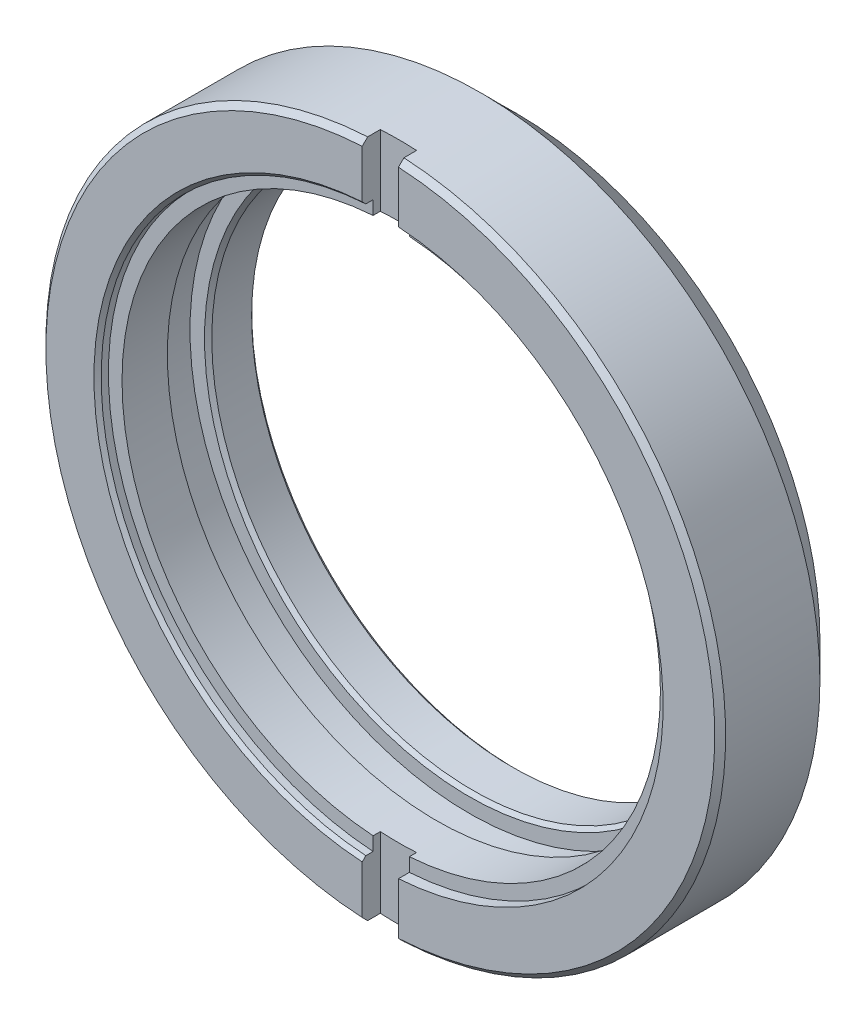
from build123d import *

# Parameters (mm, degrees)
SKETCH1_R             = 23.8125
BAR_DEPTH             = 9.525
SKETCH2_R             = 19.812
SBE_C_BORE_DEPTH      = 0.762
SKETCH4_R             = 18.8595
SBE_PUMP_THREAD_DEPTH = 5.461
SKETCH5_R             = 18.288
SBE_ORING_BORE_DEPTH  = 35.246109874
CHAMFER2_SIZE         = 0.381
SKETCH6_W             = 2.54
SKETCH6_H             = 50.8
DRIVE_SLOTS_DEPTH     = 1.27
ORING_CHAMFER_SIZE    = 2.54
SKETCH7_R             = 19.558
THREAD_RELIF_DEPTH    = 2.286
CHAMFER4_SIZE         = 0.254


with BuildPart() as part:
    # Sketch1 → bar (new body)
    with BuildSketch(Plane.XY):
        with Locations(Location((0, 0, 0), (0, 0, 180))):
            Circle(SKETCH1_R)
    extrude(amount=BAR_DEPTH)

    # Sketch2 → sbe c bore (cut)
    with BuildSketch(Plane.XY.offset(9.525)):
        Circle(SKETCH2_R)
    extrude(amount=-SBE_C_BORE_DEPTH, mode=Mode.SUBTRACT)

    # Sketch4 → sbe pump thread (cut)
    with BuildSketch(Plane.XY.offset(8.763)):
        Circle(SKETCH4_R)
    extrude(amount=-SBE_PUMP_THREAD_DEPTH, mode=Mode.SUBTRACT)

    # Sketch5 → sbe oring bore (cut, through all)
    with BuildSketch(Plane.XY.offset(3.302)):
        Circle(SKETCH5_R)
    extrude(amount=-SBE_ORING_BORE_DEPTH, mode=Mode.SUBTRACT)

    # Chamfer2
    chamfer2_edges = [part.edges().sort_by_distance(p)[0] for p in [
        (23.8125, 0, 9.525),
    ]]
    chamfer(chamfer2_edges, length=CHAMFER2_SIZE)

    # Sketch6 → drive slots (cut)
    with BuildSketch(Plane.XY.offset(9.525)):
        Rectangle(SKETCH6_W, SKETCH6_H)
    extrude(amount=-DRIVE_SLOTS_DEPTH, mode=Mode.SUBTRACT)

    # oring chamfer
    oring_chamfer_edges = [part.edges().sort_by_distance(p)[0] for p in [
        (23.8125, 0, 0),
    ]]
    chamfer(oring_chamfer_edges, length=ORING_CHAMFER_SIZE)

    # Sketch7 → thread relif (cut)
    with BuildSketch(Plane.XY.offset(3.302)):
        Circle(SKETCH7_R)
    extrude(amount=THREAD_RELIF_DEPTH, mode=Mode.SUBTRACT)

    # Chamfer4
    chamfer4_edges = [part.edges().sort_by_distance(p)[0] for p in [
        (-18.288, 0, 0),
        (-18.288, 0, 3.302),
        (-19.812, 0, 9.525),
    ]]
    chamfer(chamfer4_edges, length=CHAMFER4_SIZE)


solid = part.part
